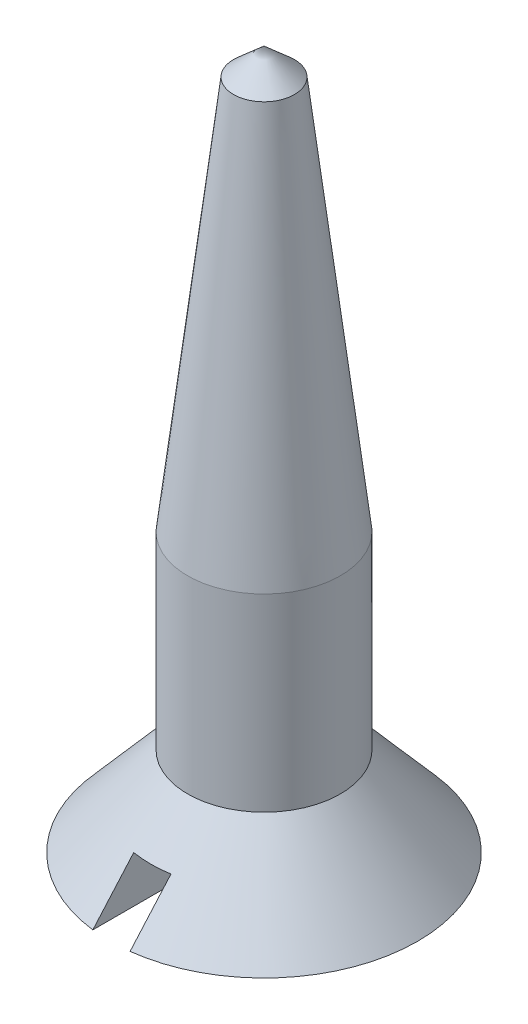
ISO-10303-21;
HEADER;
FILE_DESCRIPTION(('STEP AP214'),'2;1');
FILE_NAME('part.step','',(''),(''),'','','');
FILE_SCHEMA(('AUTOMOTIVE_DESIGN { 1 0 10303 214 1 1 1 1 }'));
ENDSEC;
DATA;
#1=APPLICATION_CONTEXT('core data for automotive mechanical design processes');
#2=APPLICATION_PROTOCOL_DEFINITION('international standard','automotive_design',2000,#1);
#3=PRODUCT_CONTEXT('',#1,'mechanical');
#4=PRODUCT('Part','Part','',(#3));
#5=PRODUCT_RELATED_PRODUCT_CATEGORY('part','',(#4));
#6=PRODUCT_DEFINITION_FORMATION('','',#4);
#7=PRODUCT_DEFINITION_CONTEXT('part definition',#1,'design');
#8=PRODUCT_DEFINITION('design','',#6,#7);
#9=PRODUCT_DEFINITION_SHAPE('','',#8);
#10=(LENGTH_UNIT() NAMED_UNIT(*) SI_UNIT(.MILLI.,.METRE.));
#11=(NAMED_UNIT(*) PLANE_ANGLE_UNIT() SI_UNIT($,.RADIAN.));
#12=(NAMED_UNIT(*) SI_UNIT($,.STERADIAN.) SOLID_ANGLE_UNIT());
#13=UNCERTAINTY_MEASURE_WITH_UNIT(LENGTH_MEASURE(1.E-05),#10,'distance_accuracy_value','');
#14=(GEOMETRIC_REPRESENTATION_CONTEXT(3) GLOBAL_UNCERTAINTY_ASSIGNED_CONTEXT((#13)) GLOBAL_UNIT_ASSIGNED_CONTEXT((#10,
#11,#12)) REPRESENTATION_CONTEXT('',''));
#15=CARTESIAN_POINT('',(0.,0.,0.));
#16=DIRECTION('',(0.,0.,1.));
#17=DIRECTION('',(1.,0.,0.));
#18=AXIS2_PLACEMENT_3D('',#15,#16,#17);
#19=CARTESIAN_POINT('',(-4.191,0.,0.));
#20=DIRECTION('',(0.,1.,0.));
#21=DIRECTION('',(0.,0.,1.));
#22=AXIS2_PLACEMENT_3D('',#19,#20,#21);
#23=PLANE('',#22);
#24=CARTESIAN_POINT('',(0.,0.,0.));
#25=DIRECTION('',(0.,-1.,0.));
#26=DIRECTION('',(0.,0.,-1.));
#27=AXIS2_PLACEMENT_3D('',#24,#25,#26);
#28=CIRCLE('',#27,4.191);
#29=CARTESIAN_POINT('',(0.508,0.,-4.16009819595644));
#30=VERTEX_POINT('',#29);
#31=CARTESIAN_POINT('',(0.508,0.,4.16009819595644));
#32=VERTEX_POINT('',#31);
#33=EDGE_CURVE('E116',#30,#32,#28,.T.);
#34=ORIENTED_EDGE('',*,*,#33,.T.);
#35=DIRECTION('',(0.,0.,-1.));
#36=VECTOR('',#35,1.);
#37=CARTESIAN_POINT('',(0.508,0.,0.));
#38=LINE('',#37,#36);
#39=EDGE_CURVE('E119',#32,#30,#38,.T.);
#40=ORIENTED_EDGE('',*,*,#39,.T.);
#41=EDGE_LOOP('',(#34,#40));
#42=FACE_BOUND('',#41,.T.);
#43=ADVANCED_FACE('F35',(#42),#23,.F.);
#44=CARTESIAN_POINT('',(-0.508,0.,4.16009819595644));
#45=VERTEX_POINT('',#44);
#46=CARTESIAN_POINT('',(-0.508,0.,-4.16009819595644));
#47=VERTEX_POINT('',#46);
#48=EDGE_CURVE('E117',#45,#47,#28,.T.);
#49=ORIENTED_EDGE('',*,*,#48,.T.);
#50=DIRECTION('',(0.,0.,1.));
#51=VECTOR('',#50,1.);
#52=CARTESIAN_POINT('',(-0.508,0.,0.));
#53=LINE('',#52,#51);
#54=EDGE_CURVE('E88',#47,#45,#53,.T.);
#55=ORIENTED_EDGE('',*,*,#54,.T.);
#56=EDGE_LOOP('',(#49,#55));
#57=FACE_BOUND('',#56,.T.);
#58=ADVANCED_FACE('F37',(#57),#23,.F.);
#59=CARTESIAN_POINT('',(0.,19.05,0.));
#60=DIRECTION('',(0.,-1.,0.));
#61=DIRECTION('',(0.,0.,-1.));
#62=AXIS2_PLACEMENT_3D('',#59,#60,#61);
#63=CONICAL_SURFACE('',#62,0.,0.847902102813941);
#64=CARTESIAN_POINT('',(0.,18.3181435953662,0.));
#65=DIRECTION('',(0.,-1.,0.));
#66=DIRECTION('',(0.,0.,-1.));
#67=AXIS2_PLACEMENT_3D('',#64,#65,#66);
#68=CIRCLE('',#67,0.829579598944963);
#69=CARTESIAN_POINT('',(0.,18.3181435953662,-0.829579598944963));
#70=VERTEX_POINT('',#69);
#71=EDGE_CURVE('E105',#70,#70,#68,.T.);
#72=ORIENTED_EDGE('',*,*,#71,.F.);
#73=EDGE_LOOP('',(#72));
#74=FACE_BOUND('',#73,.T.);
#75=CARTESIAN_POINT('',(0.,19.05,0.));
#76=VERTEX_POINT('',#75);
#77=VERTEX_LOOP('',#76);
#78=FACE_BOUND('',#77,.T.);
#79=ADVANCED_FACE('F125',(#74,#78),#63,.T.);
#80=CARTESIAN_POINT('',(0.,18.3181435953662,0.));
#81=DIRECTION('',(0.,-1.,0.));
#82=DIRECTION('',(0.,0.,-1.));
#83=AXIS2_PLACEMENT_3D('',#80,#81,#82);
#84=CONICAL_SURFACE('',#83,0.829579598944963,0.116164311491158);
#85=CARTESIAN_POINT('',(0.,7.57837110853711,0.));
#86=DIRECTION('',(0.,-1.,0.));
#87=DIRECTION('',(0.,0.,-1.));
#88=AXIS2_PLACEMENT_3D('',#85,#86,#87);
#89=CIRCLE('',#88,2.0828);
#90=CARTESIAN_POINT('',(0.,7.57837110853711,-2.0828));
#91=VERTEX_POINT('',#90);
#92=EDGE_CURVE('E107',#91,#91,#89,.T.);
#93=ORIENTED_EDGE('',*,*,#92,.F.);
#94=EDGE_LOOP('',(#93));
#95=FACE_BOUND('',#94,.T.);
#96=ORIENTED_EDGE('',*,*,#71,.T.);
#97=EDGE_LOOP('',(#96));
#98=FACE_BOUND('',#97,.T.);
#99=ADVANCED_FACE('F130',(#95,#98),#84,.T.);
#100=CARTESIAN_POINT('',(0.,0.,0.));
#101=DIRECTION('',(0.,-1.,0.));
#102=DIRECTION('',(0.,0.,-1.));
#103=AXIS2_PLACEMENT_3D('',#100,#101,#102);
#104=CYLINDRICAL_SURFACE('',#103,2.0828);
#105=CARTESIAN_POINT('',(0.,2.42520667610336,0.));
#106=DIRECTION('',(0.,-1.,0.));
#107=DIRECTION('',(0.,0.,-1.));
#108=AXIS2_PLACEMENT_3D('',#105,#106,#107);
#109=CIRCLE('',#108,2.0828);
#110=CARTESIAN_POINT('',(0.,2.42520667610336,-2.0828));
#111=VERTEX_POINT('',#110);
#112=EDGE_CURVE('E111',#111,#111,#109,.T.);
#113=ORIENTED_EDGE('',*,*,#112,.F.);
#114=EDGE_LOOP('',(#113));
#115=FACE_BOUND('',#114,.T.);
#116=ORIENTED_EDGE('',*,*,#92,.T.);
#117=EDGE_LOOP('',(#116));
#118=FACE_BOUND('',#117,.T.);
#119=ADVANCED_FACE('F144',(#115,#118),#104,.T.);
#120=CARTESIAN_POINT('',(0.,2.42520667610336,0.));
#121=DIRECTION('',(0.,-1.,0.));
#122=DIRECTION('',(0.,0.,-1.));
#123=AXIS2_PLACEMENT_3D('',#120,#121,#122);
#124=CONICAL_SURFACE('',#123,2.0828,0.715584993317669);
#125=ORIENTED_EDGE('',*,*,#33,.F.);
#126=CARTESIAN_POINT('',(0.508,-5.08679971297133,-8.59789320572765));
#127=CARTESIAN_POINT('',(0.508,-4.75649851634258,-8.31026230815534));
#128=CARTESIAN_POINT('',(0.508,-4.42621872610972,-8.02260681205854));
#129=CARTESIAN_POINT('',(0.508,-3.76572664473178,-7.44721501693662));
#130=CARTESIAN_POINT('',(0.508,-3.43551435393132,-7.15947871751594));
#131=CARTESIAN_POINT('',(0.508,-2.77510556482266,-6.58382711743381));
#132=CARTESIAN_POINT('',(0.508,-2.4449090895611,-6.29591179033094));
#133=CARTESIAN_POINT('',(0.508,-1.78466017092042,-5.7199191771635));
#134=CARTESIAN_POINT('',(0.508,-1.45460772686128,-5.4318418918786));
#135=CARTESIAN_POINT('',(0.508,-0.801713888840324,-4.86152833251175));
#136=CARTESIAN_POINT('',(0.508,-0.478867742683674,-4.5792974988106));
#137=CARTESIAN_POINT('',(0.508,0.166467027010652,-4.01441793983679));
#138=CARTESIAN_POINT('',(0.508,0.488955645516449,-3.73176920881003));
#139=CARTESIAN_POINT('',(0.508,0.972127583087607,-3.30721614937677));
#140=CARTESIAN_POINT('',(0.508,1.13307689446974,-3.16561461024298));
#141=CARTESIAN_POINT('',(0.508,1.4547087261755,-2.88210894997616));
#142=CARTESIAN_POINT('',(0.508,1.61539124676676,-2.74020482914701));
#143=CARTESIAN_POINT('',(0.508,1.93633540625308,-2.4559287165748));
#144=CARTESIAN_POINT('',(0.508,2.09659705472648,-2.31355673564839));
#145=CARTESIAN_POINT('',(0.508,2.41642656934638,-2.02803627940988));
#146=CARTESIAN_POINT('',(0.508,2.57599444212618,-1.88488781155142));
#147=CARTESIAN_POINT('',(0.508,2.81852972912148,-1.66525432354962));
#148=CARTESIAN_POINT('',(0.508,2.90198299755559,-1.58930667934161));
#149=CARTESIAN_POINT('',(0.508,3.06833541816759,-1.43676793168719));
#150=CARTESIAN_POINT('',(0.508,3.15123443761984,-1.36017668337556));
#151=CARTESIAN_POINT('',(0.508,3.31660756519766,-1.20557567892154));
#152=CARTESIAN_POINT('',(0.508,3.39907642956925,-1.12756027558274));
#153=CARTESIAN_POINT('',(0.508,3.52152330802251,-1.00927803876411));
#154=CARTESIAN_POINT('',(0.508,3.56211870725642,-0.969651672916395));
#155=CARTESIAN_POINT('',(0.508,3.64272314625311,-0.88980890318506));
#156=CARTESIAN_POINT('',(0.508,3.68273221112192,-0.849592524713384));
#157=CARTESIAN_POINT('',(0.508,3.7617512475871,-0.76848402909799));
#158=CARTESIAN_POINT('',(0.508,3.80076446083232,-0.727595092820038));
#159=CARTESIAN_POINT('',(0.508,3.8775437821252,-0.644550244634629));
#160=CARTESIAN_POINT('',(0.508,3.91530804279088,-0.602392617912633));
#161=CARTESIAN_POINT('',(0.508,3.98858562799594,-0.516365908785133));
#162=CARTESIAN_POINT('',(0.508,4.02410627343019,-0.472503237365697));
#163=CARTESIAN_POINT('',(0.508,4.07439895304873,-0.404553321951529));
#164=CARTESIAN_POINT('',(0.508,4.09064865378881,-0.381570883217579));
#165=CARTESIAN_POINT('',(0.508,4.12173191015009,-0.334674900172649));
#166=CARTESIAN_POINT('',(0.508,4.136565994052,-0.310761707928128));
#167=CARTESIAN_POINT('',(0.508,4.17012962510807,-0.251363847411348));
#168=CARTESIAN_POINT('',(0.508,4.18783922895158,-0.215276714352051));
#169=CARTESIAN_POINT('',(0.508,4.21616239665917,-0.140566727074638));
#170=CARTESIAN_POINT('',(0.508,4.22684203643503,-0.101971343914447));
#171=CARTESIAN_POINT('',(0.508,4.23620088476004,-0.0355144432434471));
#172=CARTESIAN_POINT('',(0.508,4.23757924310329,-0.00804758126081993));
#173=CARTESIAN_POINT('',(0.508,4.23518948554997,0.0466878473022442));
#174=CARTESIAN_POINT('',(0.508,4.23141336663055,0.0739560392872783));
#175=CARTESIAN_POINT('',(0.508,4.21758346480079,0.135832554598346));
#176=CARTESIAN_POINT('',(0.508,4.20593691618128,0.170072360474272));
#177=CARTESIAN_POINT('',(0.508,4.18470804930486,0.219782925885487));
#178=CARTESIAN_POINT('',(0.508,4.17697915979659,0.236120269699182));
#179=CARTESIAN_POINT('',(0.508,4.16052350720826,0.268285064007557));
#180=CARTESIAN_POINT('',(0.508,4.15179699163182,0.284112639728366));
#181=CARTESIAN_POINT('',(0.508,4.1272329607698,0.326142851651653));
#182=CARTESIAN_POINT('',(0.508,4.11066648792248,0.351915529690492));
#183=CARTESIAN_POINT('',(0.508,4.07601961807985,0.40243034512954));
#184=CARTESIAN_POINT('',(0.508,4.0579380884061,0.42717169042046));
#185=CARTESIAN_POINT('',(0.508,4.00206009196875,0.500316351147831));
#186=CARTESIAN_POINT('',(0.508,3.96270619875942,0.547521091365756));
#187=CARTESIAN_POINT('',(0.508,3.88160037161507,0.640276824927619));
#188=CARTESIAN_POINT('',(0.508,3.83983523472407,0.685815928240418));
#189=CARTESIAN_POINT('',(0.508,3.75505442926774,0.775572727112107));
#190=CARTESIAN_POINT('',(0.508,3.71204088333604,0.819792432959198));
#191=CARTESIAN_POINT('',(0.508,3.62583218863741,0.906733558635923));
#192=CARTESIAN_POINT('',(0.508,3.58264959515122,0.949467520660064));
#193=CARTESIAN_POINT('',(0.508,3.49572338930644,1.03436205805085));
#194=CARTESIAN_POINT('',(0.508,3.45197976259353,1.07652261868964));
#195=CARTESIAN_POINT('',(0.508,3.32014883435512,1.20239723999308));
#196=CARTESIAN_POINT('',(0.508,3.23147258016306,1.28549324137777));
#197=CARTESIAN_POINT('',(0.508,3.05316681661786,1.45081957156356));
#198=CARTESIAN_POINT('',(0.508,2.96353648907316,1.53304901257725));
#199=CARTESIAN_POINT('',(0.508,2.78373364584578,1.69689927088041));
#200=CARTESIAN_POINT('',(0.508,2.69356117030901,1.77852013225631));
#201=CARTESIAN_POINT('',(0.508,2.51346429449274,1.9408090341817));
#202=CARTESIAN_POINT('',(0.508,2.42354233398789,2.02147978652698));
#203=CARTESIAN_POINT('',(0.508,2.24344543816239,2.18254168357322));
#204=CARTESIAN_POINT('',(0.508,2.15327049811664,2.26293282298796));
#205=CARTESIAN_POINT('',(0.508,1.88255057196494,2.50373627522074));
#206=CARTESIAN_POINT('',(0.508,1.70173605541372,2.6638454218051));
#207=CARTESIAN_POINT('',(0.508,1.2484392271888,3.06421646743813));
#208=CARTESIAN_POINT('',(0.508,0.975702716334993,3.30419019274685));
#209=CARTESIAN_POINT('',(0.508,0.429763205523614,3.78360796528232));
#210=CARTESIAN_POINT('',(0.508,0.156560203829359,4.02305201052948));
#211=CARTESIAN_POINT('',(0.508,-0.663544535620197,4.7410182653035));
#212=CARTESIAN_POINT('',(0.508,-1.21084281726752,5.21908736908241));
#213=CARTESIAN_POINT('',(0.508,-2.31283587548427,6.18081443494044));
#214=CARTESIAN_POINT('',(0.508,-2.86753614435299,6.66446609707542));
#215=CARTESIAN_POINT('',(0.508,-3.69971293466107,7.38969059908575));
#216=CARTESIAN_POINT('',(0.508,-3.97709950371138,7.63136663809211));
#217=CARTESIAN_POINT('',(0.508,-4.53191858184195,8.11466569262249));
#218=CARTESIAN_POINT('',(0.508,-4.80935109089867,8.35628870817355));
#219=CARTESIAN_POINT('',(0.508,-5.08679971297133,8.59789320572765));
#220=B_SPLINE_CURVE_WITH_KNOTS('',3,(#126,#127,#128,#129,#130,#131,#132,#133,#134,#135,#136,
#137,#138,#139,#140,#141,#142,#143,#144,#145,#146,#147,#148,#149,#150,#151,#152,#153,#154,#155,
#156,#157,#158,#159,#160,#161,#162,#163,#164,#165,#166,#167,#168,#169,#170,#171,#172,#173,#174,
#175,#176,#177,#178,#179,#180,#181,#182,#183,#184,#185,#186,#187,#188,#189,#190,#191,#192,#193,
#194,#195,#196,#197,#198,#199,#200,#201,#202,#203,#204,#205,#206,#207,#208,#209,#210,#211,#212,
#213,#214,#215,#216,#217,#218,#219),.UNSPECIFIED.,.F.,.F.,(4,2,2,2,2,2,2,2,2,2,2,2,2,2,2,2,2,2,
2,2,2,2,2,2,2,2,2,2,2,2,2,2,2,2,2,2,2,2,2,2,2,2,2,2,2,2,4),(0.,1.3139534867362,2.62791352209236,
3.94219068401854,5.25646157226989,6.54291197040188,7.82938024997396,8.47249829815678,
9.11561570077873,9.75871833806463,10.4018148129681,10.7403275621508,11.0789186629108,
11.4194712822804,11.5896554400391,11.759832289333,11.9293568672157,12.0991218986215,
12.2683008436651,12.3527021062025,12.4370717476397,12.5572607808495,12.6763033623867,
12.7583245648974,12.8404732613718,12.9482883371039,13.0024904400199,13.0566791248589,
13.1485080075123,13.2404061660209,13.4246248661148,13.6099710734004,13.7950187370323,
13.9772714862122,14.1595289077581,14.5240906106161,14.8889952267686,15.2538731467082,
15.6162859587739,15.9787055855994,16.7032448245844,17.7930844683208,18.8829281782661,
21.063011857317,23.2708392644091,24.3745400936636,25.4782403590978),.UNSPECIFIED.);
#221=CARTESIAN_POINT('',(0.508,1.27,-3.04492053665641));
#222=VERTEX_POINT('',#221);
#223=EDGE_CURVE('E11',#30,#222,#220,.T.);
#224=ORIENTED_EDGE('',*,*,#223,.T.);
#225=CARTESIAN_POINT('',(0.,1.27,0.));
#226=DIRECTION('',(0.,1.,0.));
#227=DIRECTION('',(0.,0.,1.));
#228=AXIS2_PLACEMENT_3D('',#225,#226,#227);
#229=CIRCLE('',#228,3.0870058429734);
#230=CARTESIAN_POINT('',(-0.508,1.27,-3.04492053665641));
#231=VERTEX_POINT('',#230);
#232=EDGE_CURVE('E93',#222,#231,#229,.T.);
#233=ORIENTED_EDGE('',*,*,#232,.T.);
#234=CARTESIAN_POINT('',(-0.508,-5.08679971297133,8.59789320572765));
#235=CARTESIAN_POINT('',(-0.508,-4.75649851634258,8.31026230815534));
#236=CARTESIAN_POINT('',(-0.508,-4.42621872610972,8.02260681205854));
#237=CARTESIAN_POINT('',(-0.508,-3.76572664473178,7.44721501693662));
#238=CARTESIAN_POINT('',(-0.508,-3.43551435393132,7.15947871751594));
#239=CARTESIAN_POINT('',(-0.508,-2.77510556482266,6.58382711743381));
#240=CARTESIAN_POINT('',(-0.508,-2.4449090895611,6.29591179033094));
#241=CARTESIAN_POINT('',(-0.508,-1.78466017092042,5.7199191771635));
#242=CARTESIAN_POINT('',(-0.508,-1.45460772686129,5.43184189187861));
#243=CARTESIAN_POINT('',(-0.508,-0.80171388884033,4.86152833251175));
#244=CARTESIAN_POINT('',(-0.508,-0.478867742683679,4.57929749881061));
#245=CARTESIAN_POINT('',(-0.508,0.166467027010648,4.01441793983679));
#246=CARTESIAN_POINT('',(-0.508,0.488955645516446,3.73176920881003));
#247=CARTESIAN_POINT('',(-0.508,0.972127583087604,3.30721614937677));
#248=CARTESIAN_POINT('',(-0.508,1.13307689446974,3.16561461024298));
#249=CARTESIAN_POINT('',(-0.508,1.45470872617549,2.88210894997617));
#250=CARTESIAN_POINT('',(-0.508,1.61539124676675,2.74020482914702));
#251=CARTESIAN_POINT('',(-0.508,1.93633540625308,2.4559287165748));
#252=CARTESIAN_POINT('',(-0.508,2.09659705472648,2.31355673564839));
#253=CARTESIAN_POINT('',(-0.508,2.41642656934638,2.02803627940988));
#254=CARTESIAN_POINT('',(-0.508,2.57599444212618,1.88488781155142));
#255=CARTESIAN_POINT('',(-0.508,2.81852972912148,1.66525432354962));
#256=CARTESIAN_POINT('',(-0.508,2.90198299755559,1.58930667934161));
#257=CARTESIAN_POINT('',(-0.508,3.06833541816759,1.43676793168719));
#258=CARTESIAN_POINT('',(-0.508,3.15123443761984,1.36017668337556));
#259=CARTESIAN_POINT('',(-0.508,3.31660756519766,1.20557567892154));
#260=CARTESIAN_POINT('',(-0.508,3.39907642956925,1.12756027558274));
#261=CARTESIAN_POINT('',(-0.508,3.52152330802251,1.00927803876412));
#262=CARTESIAN_POINT('',(-0.508,3.56211870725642,0.969651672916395));
#263=CARTESIAN_POINT('',(-0.508,3.64272314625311,0.88980890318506));
#264=CARTESIAN_POINT('',(-0.508,3.68273221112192,0.849592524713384));
#265=CARTESIAN_POINT('',(-0.508,3.7617512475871,0.76848402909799));
#266=CARTESIAN_POINT('',(-0.508,3.80076446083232,0.727595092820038));
#267=CARTESIAN_POINT('',(-0.508,3.8775437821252,0.644550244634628));
#268=CARTESIAN_POINT('',(-0.508,3.91530804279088,0.602392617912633));
#269=CARTESIAN_POINT('',(-0.508,3.98858562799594,0.516365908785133));
#270=CARTESIAN_POINT('',(-0.508,4.02410627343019,0.472503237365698));
#271=CARTESIAN_POINT('',(-0.508,4.07439895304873,0.40455332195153));
#272=CARTESIAN_POINT('',(-0.508,4.09064865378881,0.38157088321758));
#273=CARTESIAN_POINT('',(-0.508,4.12173191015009,0.33467490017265));
#274=CARTESIAN_POINT('',(-0.508,4.136565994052,0.310761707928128));
#275=CARTESIAN_POINT('',(-0.508,4.17012962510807,0.251363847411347));
#276=CARTESIAN_POINT('',(-0.508,4.18783922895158,0.215276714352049));
#277=CARTESIAN_POINT('',(-0.508,4.21616239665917,0.140566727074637));
#278=CARTESIAN_POINT('',(-0.508,4.22684203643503,0.101971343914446));
#279=CARTESIAN_POINT('',(-0.508,4.23620088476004,0.0355144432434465));
#280=CARTESIAN_POINT('',(-0.508,4.23757924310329,0.00804758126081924));
#281=CARTESIAN_POINT('',(-0.508,4.23518948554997,-0.0466878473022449));
#282=CARTESIAN_POINT('',(-0.508,4.23141336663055,-0.073956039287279));
#283=CARTESIAN_POINT('',(-0.508,4.21758346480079,-0.135832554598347));
#284=CARTESIAN_POINT('',(-0.508,4.20593691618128,-0.170072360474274));
#285=CARTESIAN_POINT('',(-0.508,4.18470804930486,-0.21978292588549));
#286=CARTESIAN_POINT('',(-0.508,4.17697915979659,-0.236120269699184));
#287=CARTESIAN_POINT('',(-0.508,4.16052350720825,-0.268285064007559));
#288=CARTESIAN_POINT('',(-0.508,4.15179699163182,-0.284112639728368));
#289=CARTESIAN_POINT('',(-0.508,4.1272329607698,-0.326142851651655));
#290=CARTESIAN_POINT('',(-0.508,4.11066648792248,-0.351915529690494));
#291=CARTESIAN_POINT('',(-0.508,4.07601961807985,-0.402430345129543));
#292=CARTESIAN_POINT('',(-0.508,4.05793808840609,-0.427171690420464));
#293=CARTESIAN_POINT('',(-0.508,4.00206009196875,-0.500316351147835));
#294=CARTESIAN_POINT('',(-0.508,3.96270619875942,-0.54752109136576));
#295=CARTESIAN_POINT('',(-0.508,3.88160037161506,-0.640276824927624));
#296=CARTESIAN_POINT('',(-0.508,3.83983523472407,-0.685815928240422));
#297=CARTESIAN_POINT('',(-0.508,3.75505442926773,-0.775572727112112));
#298=CARTESIAN_POINT('',(-0.508,3.71204088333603,-0.819792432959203));
#299=CARTESIAN_POINT('',(-0.508,3.62583218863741,-0.906733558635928));
#300=CARTESIAN_POINT('',(-0.508,3.58264959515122,-0.949467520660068));
#301=CARTESIAN_POINT('',(-0.508,3.49572338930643,-1.03436205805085));
#302=CARTESIAN_POINT('',(-0.508,3.45197976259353,-1.07652261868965));
#303=CARTESIAN_POINT('',(-0.508,3.32014883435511,-1.20239723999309));
#304=CARTESIAN_POINT('',(-0.508,3.23147258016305,-1.28549324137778));
#305=CARTESIAN_POINT('',(-0.508,3.05316681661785,-1.45081957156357));
#306=CARTESIAN_POINT('',(-0.508,2.96353648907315,-1.53304901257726));
#307=CARTESIAN_POINT('',(-0.508,2.78373364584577,-1.69689927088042));
#308=CARTESIAN_POINT('',(-0.508,2.693561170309,-1.77852013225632));
#309=CARTESIAN_POINT('',(-0.508,2.51346429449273,-1.94080903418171));
#310=CARTESIAN_POINT('',(-0.508,2.42354233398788,-2.02147978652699));
#311=CARTESIAN_POINT('',(-0.508,2.24344543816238,-2.18254168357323));
#312=CARTESIAN_POINT('',(-0.508,2.15327049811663,-2.26293282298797));
#313=CARTESIAN_POINT('',(-0.508,1.88255057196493,-2.50373627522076));
#314=CARTESIAN_POINT('',(-0.508,1.7017360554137,-2.66384542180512));
#315=CARTESIAN_POINT('',(-0.508,1.24843922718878,-3.06421646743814));
#316=CARTESIAN_POINT('',(-0.508,0.975702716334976,-3.30419019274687));
#317=CARTESIAN_POINT('',(-0.508,0.4297632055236,-3.78360796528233));
#318=CARTESIAN_POINT('',(-0.508,0.156560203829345,-4.02305201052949));
#319=CARTESIAN_POINT('',(-0.508,-0.663544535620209,-4.74101826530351));
#320=CARTESIAN_POINT('',(-0.508,-1.21084281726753,-5.21908736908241));
#321=CARTESIAN_POINT('',(-0.508,-2.31283587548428,-6.18081443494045));
#322=CARTESIAN_POINT('',(-0.508,-2.86753614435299,-6.66446609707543));
#323=CARTESIAN_POINT('',(-0.508,-3.69971293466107,-7.38969059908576));
#324=CARTESIAN_POINT('',(-0.508,-3.97709950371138,-7.63136663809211));
#325=CARTESIAN_POINT('',(-0.508,-4.53191858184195,-8.11466569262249));
#326=CARTESIAN_POINT('',(-0.508,-4.80935109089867,-8.35628870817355));
#327=CARTESIAN_POINT('',(-0.508,-5.08679971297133,-8.59789320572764));
#328=B_SPLINE_CURVE_WITH_KNOTS('',3,(#234,#235,#236,#237,#238,#239,#240,#241,#242,#243,#244,
#245,#246,#247,#248,#249,#250,#251,#252,#253,#254,#255,#256,#257,#258,#259,#260,#261,#262,#263,
#264,#265,#266,#267,#268,#269,#270,#271,#272,#273,#274,#275,#276,#277,#278,#279,#280,#281,#282,
#283,#284,#285,#286,#287,#288,#289,#290,#291,#292,#293,#294,#295,#296,#297,#298,#299,#300,#301,
#302,#303,#304,#305,#306,#307,#308,#309,#310,#311,#312,#313,#314,#315,#316,#317,#318,#319,#320,
#321,#322,#323,#324,#325,#326,#327),.UNSPECIFIED.,.F.,.F.,(4,2,2,2,2,2,2,2,2,2,2,2,2,2,2,2,2,2,
2,2,2,2,2,2,2,2,2,2,2,2,2,2,2,2,2,2,2,2,2,2,2,2,2,2,2,2,4),(0.,1.31395348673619,
2.62791352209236,3.94219068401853,5.25646157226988,6.54291197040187,7.82938024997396,
8.47249829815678,9.11561570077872,9.75871833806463,10.4018148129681,10.7403275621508,
11.0789186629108,11.4194712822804,11.5896554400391,11.7598322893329,11.9293568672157,
12.0991218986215,12.2683008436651,12.3527021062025,12.4370717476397,12.5572607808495,
12.6763033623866,12.7583245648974,12.8404732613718,12.9482883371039,13.0024904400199,
13.0566791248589,13.1485080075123,13.2404061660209,13.4246248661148,13.6099710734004,
13.7950187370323,13.9772714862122,14.1595289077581,14.5240906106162,14.8889952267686,
15.2538731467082,15.6162859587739,15.9787055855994,16.7032448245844,17.7930844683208,
18.8829281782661,21.063011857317,23.2708392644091,24.3745400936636,25.4782403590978),.UNSPECIFIED.);
#329=EDGE_CURVE('E50',#231,#47,#328,.T.);
#330=ORIENTED_EDGE('',*,*,#329,.T.);
#331=ORIENTED_EDGE('',*,*,#48,.F.);
#332=CARTESIAN_POINT('',(-0.508,1.27,3.04492053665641));
#333=VERTEX_POINT('',#332);
#334=EDGE_CURVE('E94',#45,#333,#328,.T.);
#335=ORIENTED_EDGE('',*,*,#334,.T.);
#336=CARTESIAN_POINT('',(0.508,1.27,3.04492053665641));
#337=VERTEX_POINT('',#336);
#338=EDGE_CURVE('E97',#333,#337,#229,.T.);
#339=ORIENTED_EDGE('',*,*,#338,.T.);
#340=EDGE_CURVE('E39',#337,#32,#220,.T.);
#341=ORIENTED_EDGE('',*,*,#340,.T.);
#342=EDGE_LOOP('',(#125,#224,#233,#330,#331,#335,#339,#341));
#343=FACE_BOUND('',#342,.T.);
#344=ORIENTED_EDGE('',*,*,#112,.T.);
#345=EDGE_LOOP('',(#344));
#346=FACE_BOUND('',#345,.T.);
#347=ADVANCED_FACE('F100',(#343,#346),#124,.T.);
#348=CARTESIAN_POINT('',(0.508,-1.27,-4.191));
#349=DIRECTION('',(1.,0.,0.));
#350=DIRECTION('',(0.,0.,-1.));
#351=AXIS2_PLACEMENT_3D('',#348,#349,#350);
#352=PLANE('',#351);
#353=ORIENTED_EDGE('',*,*,#39,.F.);
#354=ORIENTED_EDGE('',*,*,#340,.F.);
#355=DIRECTION('',(0.,0.,1.));
#356=VECTOR('',#355,1.);
#357=CARTESIAN_POINT('',(0.508,1.27,-4.191));
#358=LINE('',#357,#356);
#359=EDGE_CURVE('E57',#222,#337,#358,.T.);
#360=ORIENTED_EDGE('',*,*,#359,.F.);
#361=ORIENTED_EDGE('',*,*,#223,.F.);
#362=EDGE_LOOP('',(#353,#354,#360,#361));
#363=FACE_BOUND('',#362,.T.);
#364=ADVANCED_FACE('F137',(#363),#352,.F.);
#365=CARTESIAN_POINT('',(-0.508,-1.27,-4.191));
#366=DIRECTION('',(-1.,0.,0.));
#367=DIRECTION('',(0.,0.,1.));
#368=AXIS2_PLACEMENT_3D('',#365,#366,#367);
#369=PLANE('',#368);
#370=ORIENTED_EDGE('',*,*,#54,.F.);
#371=ORIENTED_EDGE('',*,*,#329,.F.);
#372=DIRECTION('',(0.,0.,1.));
#373=VECTOR('',#372,1.);
#374=CARTESIAN_POINT('',(-0.508,1.27,-4.191));
#375=LINE('',#374,#373);
#376=EDGE_CURVE('E85',#231,#333,#375,.T.);
#377=ORIENTED_EDGE('',*,*,#376,.T.);
#378=ORIENTED_EDGE('',*,*,#334,.F.);
#379=EDGE_LOOP('',(#370,#371,#377,#378));
#380=FACE_BOUND('',#379,.T.);
#381=ADVANCED_FACE('F84',(#380),#369,.F.);
#382=CARTESIAN_POINT('',(-0.508,1.27,-4.191));
#383=DIRECTION('',(0.,1.,0.));
#384=DIRECTION('',(0.,0.,1.));
#385=AXIS2_PLACEMENT_3D('',#382,#383,#384);
#386=PLANE('',#385);
#387=ORIENTED_EDGE('',*,*,#359,.T.);
#388=ORIENTED_EDGE('',*,*,#338,.F.);
#389=ORIENTED_EDGE('',*,*,#376,.F.);
#390=ORIENTED_EDGE('',*,*,#232,.F.);
#391=EDGE_LOOP('',(#387,#388,#389,#390));
#392=FACE_BOUND('',#391,.T.);
#393=ADVANCED_FACE('F95',(#392),#386,.F.);
#394=CLOSED_SHELL('',(#43,#58,#79,#99,#119,#347,#364,#381,#393));
#395=MANIFOLD_SOLID_BREP('B2',#394);
#396=ADVANCED_BREP_SHAPE_REPRESENTATION('',(#18,#395),#14);
#397=SHAPE_DEFINITION_REPRESENTATION(#9,#396);
ENDSEC;
END-ISO-10303-21;
